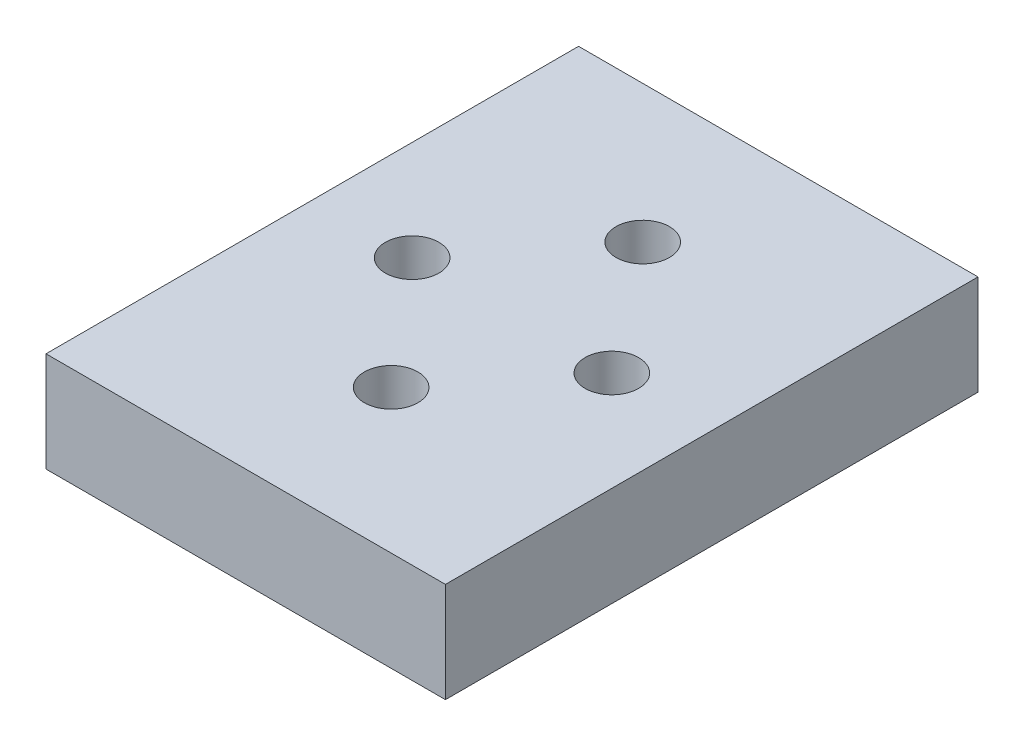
ISO-10303-21;
HEADER;
FILE_DESCRIPTION(('STEP AP214'),'2;1');
FILE_NAME('part.step','',(''),(''),'','','');
FILE_SCHEMA(('AUTOMOTIVE_DESIGN { 1 0 10303 214 1 1 1 1 }'));
ENDSEC;
DATA;
#1=APPLICATION_CONTEXT('core data for automotive mechanical design processes');
#2=APPLICATION_PROTOCOL_DEFINITION('international standard','automotive_design',2000,#1);
#3=PRODUCT_CONTEXT('',#1,'mechanical');
#4=PRODUCT('Part','Part','',(#3));
#5=PRODUCT_RELATED_PRODUCT_CATEGORY('part','',(#4));
#6=PRODUCT_DEFINITION_FORMATION('','',#4);
#7=PRODUCT_DEFINITION_CONTEXT('part definition',#1,'design');
#8=PRODUCT_DEFINITION('design','',#6,#7);
#9=PRODUCT_DEFINITION_SHAPE('','',#8);
#10=(LENGTH_UNIT() NAMED_UNIT(*) SI_UNIT(.MILLI.,.METRE.));
#11=(NAMED_UNIT(*) PLANE_ANGLE_UNIT() SI_UNIT($,.RADIAN.));
#12=(NAMED_UNIT(*) SI_UNIT($,.STERADIAN.) SOLID_ANGLE_UNIT());
#13=UNCERTAINTY_MEASURE_WITH_UNIT(LENGTH_MEASURE(1.E-05),#10,'distance_accuracy_value','');
#14=(GEOMETRIC_REPRESENTATION_CONTEXT(3) GLOBAL_UNCERTAINTY_ASSIGNED_CONTEXT((#13)) GLOBAL_UNIT_ASSIGNED_CONTEXT((#10,
#11,#12)) REPRESENTATION_CONTEXT('',''));
#15=CARTESIAN_POINT('',(0.,0.,0.));
#16=DIRECTION('',(0.,0.,1.));
#17=DIRECTION('',(1.,0.,0.));
#18=AXIS2_PLACEMENT_3D('',#15,#16,#17);
#19=CARTESIAN_POINT('',(19.05,4.7625,-25.4));
#20=DIRECTION('',(-1.,0.,0.));
#21=DIRECTION('',(0.,0.,1.));
#22=AXIS2_PLACEMENT_3D('',#19,#20,#21);
#23=PLANE('',#22);
#24=DIRECTION('',(0.,0.,-1.));
#25=VECTOR('',#24,1.);
#26=CARTESIAN_POINT('',(19.05,-4.7625,-25.4));
#27=LINE('',#26,#25);
#28=CARTESIAN_POINT('',(19.05,-4.7625,25.4));
#29=VERTEX_POINT('',#28);
#30=CARTESIAN_POINT('',(19.05,-4.7625,-25.4));
#31=VERTEX_POINT('',#30);
#32=EDGE_CURVE('E100',#29,#31,#27,.T.);
#33=ORIENTED_EDGE('',*,*,#32,.T.);
#34=DIRECTION('',(0.,-1.,0.));
#35=VECTOR('',#34,1.);
#36=CARTESIAN_POINT('',(19.05,4.7625,-25.4));
#37=LINE('',#36,#35);
#38=CARTESIAN_POINT('',(19.05,4.7625,-25.4));
#39=VERTEX_POINT('',#38);
#40=EDGE_CURVE('E11',#39,#31,#37,.T.);
#41=ORIENTED_EDGE('',*,*,#40,.F.);
#42=DIRECTION('',(0.,0.,-1.));
#43=VECTOR('',#42,1.);
#44=CARTESIAN_POINT('',(19.05,4.7625,-25.4));
#45=LINE('',#44,#43);
#46=CARTESIAN_POINT('',(19.05,4.7625,25.4));
#47=VERTEX_POINT('',#46);
#48=EDGE_CURVE('E88',#47,#39,#45,.T.);
#49=ORIENTED_EDGE('',*,*,#48,.F.);
#50=DIRECTION('',(0.,-1.,0.));
#51=VECTOR('',#50,1.);
#52=CARTESIAN_POINT('',(19.05,4.7625,25.4));
#53=LINE('',#52,#51);
#54=EDGE_CURVE('E96',#47,#29,#53,.T.);
#55=ORIENTED_EDGE('',*,*,#54,.T.);
#56=EDGE_LOOP('',(#33,#41,#49,#55));
#57=FACE_BOUND('',#56,.T.);
#58=ADVANCED_FACE('F37',(#57),#23,.F.);
#59=CARTESIAN_POINT('',(-19.05,4.7625,-25.4));
#60=DIRECTION('',(0.,0.,1.));
#61=DIRECTION('',(1.,0.,0.));
#62=AXIS2_PLACEMENT_3D('',#59,#60,#61);
#63=PLANE('',#62);
#64=DIRECTION('',(-1.,0.,0.));
#65=VECTOR('',#64,1.);
#66=CARTESIAN_POINT('',(-19.05,-4.7625,-25.4));
#67=LINE('',#66,#65);
#68=CARTESIAN_POINT('',(-19.05,-4.7625,-25.4));
#69=VERTEX_POINT('',#68);
#70=EDGE_CURVE('E92',#31,#69,#67,.T.);
#71=ORIENTED_EDGE('',*,*,#70,.T.);
#72=DIRECTION('',(0.,-1.,0.));
#73=VECTOR('',#72,1.);
#74=CARTESIAN_POINT('',(-19.05,4.7625,-25.4));
#75=LINE('',#74,#73);
#76=CARTESIAN_POINT('',(-19.05,4.7625,-25.4));
#77=VERTEX_POINT('',#76);
#78=EDGE_CURVE('E45',#77,#69,#75,.T.);
#79=ORIENTED_EDGE('',*,*,#78,.F.);
#80=DIRECTION('',(-1.,0.,0.));
#81=VECTOR('',#80,1.);
#82=CARTESIAN_POINT('',(-19.05,4.7625,-25.4));
#83=LINE('',#82,#81);
#84=EDGE_CURVE('E83',#39,#77,#83,.T.);
#85=ORIENTED_EDGE('',*,*,#84,.F.);
#86=ORIENTED_EDGE('',*,*,#40,.T.);
#87=EDGE_LOOP('',(#71,#79,#85,#86));
#88=FACE_BOUND('',#87,.T.);
#89=ADVANCED_FACE('F91',(#88),#63,.F.);
#90=CARTESIAN_POINT('',(-19.05,4.7625,-25.4));
#91=DIRECTION('',(1.,0.,0.));
#92=DIRECTION('',(0.,0.,-1.));
#93=AXIS2_PLACEMENT_3D('',#90,#91,#92);
#94=PLANE('',#93);
#95=DIRECTION('',(0.,0.,1.));
#96=VECTOR('',#95,1.);
#97=CARTESIAN_POINT('',(-19.05,-4.7625,-25.4));
#98=LINE('',#97,#96);
#99=CARTESIAN_POINT('',(-19.05,-4.7625,25.4));
#100=VERTEX_POINT('',#99);
#101=EDGE_CURVE('E70',#69,#100,#98,.T.);
#102=ORIENTED_EDGE('',*,*,#101,.T.);
#103=DIRECTION('',(0.,-1.,0.));
#104=VECTOR('',#103,1.);
#105=CARTESIAN_POINT('',(-19.05,4.7625,25.4));
#106=LINE('',#105,#104);
#107=CARTESIAN_POINT('',(-19.05,4.7625,25.4));
#108=VERTEX_POINT('',#107);
#109=EDGE_CURVE('E93',#108,#100,#106,.T.);
#110=ORIENTED_EDGE('',*,*,#109,.F.);
#111=DIRECTION('',(0.,0.,1.));
#112=VECTOR('',#111,1.);
#113=CARTESIAN_POINT('',(-19.05,4.7625,-25.4));
#114=LINE('',#113,#112);
#115=EDGE_CURVE('E86',#77,#108,#114,.T.);
#116=ORIENTED_EDGE('',*,*,#115,.F.);
#117=ORIENTED_EDGE('',*,*,#78,.T.);
#118=EDGE_LOOP('',(#102,#110,#116,#117));
#119=FACE_BOUND('',#118,.T.);
#120=ADVANCED_FACE('F94',(#119),#94,.F.);
#121=CARTESIAN_POINT('',(-19.05,4.7625,25.4));
#122=DIRECTION('',(0.,0.,-1.));
#123=DIRECTION('',(-1.,0.,0.));
#124=AXIS2_PLACEMENT_3D('',#121,#122,#123);
#125=PLANE('',#124);
#126=DIRECTION('',(1.,0.,0.));
#127=VECTOR('',#126,1.);
#128=CARTESIAN_POINT('',(-19.05,-4.7625,25.4));
#129=LINE('',#128,#127);
#130=EDGE_CURVE('E76',#100,#29,#129,.T.);
#131=ORIENTED_EDGE('',*,*,#130,.T.);
#132=ORIENTED_EDGE('',*,*,#54,.F.);
#133=DIRECTION('',(1.,0.,0.));
#134=VECTOR('',#133,1.);
#135=CARTESIAN_POINT('',(-19.05,4.7625,25.4));
#136=LINE('',#135,#134);
#137=EDGE_CURVE('E53',#108,#47,#136,.T.);
#138=ORIENTED_EDGE('',*,*,#137,.F.);
#139=ORIENTED_EDGE('',*,*,#109,.T.);
#140=EDGE_LOOP('',(#131,#132,#138,#139));
#141=FACE_BOUND('',#140,.T.);
#142=ADVANCED_FACE('F108',(#141),#125,.F.);
#143=CARTESIAN_POINT('',(0.,4.7625,0.));
#144=DIRECTION('',(0.,1.,0.));
#145=DIRECTION('',(0.,0.,1.));
#146=AXIS2_PLACEMENT_3D('',#143,#144,#145);
#147=PLANE('',#146);
#148=CARTESIAN_POINT('',(0.18139999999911,4.7625,11.7111139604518));
#149=DIRECTION('',(0.,-1.,0.));
#150=DIRECTION('',(0.,0.,-1.));
#151=AXIS2_PLACEMENT_3D('',#148,#149,#150);
#152=CIRCLE('',#151,2.5527);
#153=CARTESIAN_POINT('',(0.18139999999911,4.7625,9.15841396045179));
#154=VERTEX_POINT('',#153);
#155=EDGE_CURVE('E143',#154,#154,#152,.T.);
#156=ORIENTED_EDGE('',*,*,#155,.T.);
#157=EDGE_LOOP('',(#156));
#158=FACE_BOUND('',#157,.T.);
#159=CARTESIAN_POINT('',(0.181399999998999,4.7625,-12.2888860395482));
#160=DIRECTION('',(0.,-1.,0.));
#161=DIRECTION('',(0.,0.,-1.));
#162=AXIS2_PLACEMENT_3D('',#159,#160,#161);
#163=CIRCLE('',#162,2.5527);
#164=CARTESIAN_POINT('',(0.181399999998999,4.7625,-14.8415860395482));
#165=VERTEX_POINT('',#164);
#166=EDGE_CURVE('E137',#165,#165,#163,.T.);
#167=ORIENTED_EDGE('',*,*,#166,.T.);
#168=EDGE_LOOP('',(#167));
#169=FACE_BOUND('',#168,.T.);
#170=CARTESIAN_POINT('',(9.525,4.7625,0.));
#171=DIRECTION('',(0.,-1.,0.));
#172=DIRECTION('',(0.,0.,-1.));
#173=AXIS2_PLACEMENT_3D('',#170,#171,#172);
#174=CIRCLE('',#173,2.5527);
#175=CARTESIAN_POINT('',(9.525,4.7625,-2.5527));
#176=VERTEX_POINT('',#175);
#177=EDGE_CURVE('E125',#176,#176,#174,.T.);
#178=ORIENTED_EDGE('',*,*,#177,.T.);
#179=EDGE_LOOP('',(#178));
#180=FACE_BOUND('',#179,.T.);
#181=CARTESIAN_POINT('',(-9.52499999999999,4.7625,0.));
#182=DIRECTION('',(0.,-1.,0.));
#183=DIRECTION('',(0.,0.,-1.));
#184=AXIS2_PLACEMENT_3D('',#181,#182,#183);
#185=CIRCLE('',#184,2.5527);
#186=CARTESIAN_POINT('',(-9.52499999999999,4.7625,-2.5527));
#187=VERTEX_POINT('',#186);
#188=EDGE_CURVE('E103',#187,#187,#185,.T.);
#189=ORIENTED_EDGE('',*,*,#188,.T.);
#190=EDGE_LOOP('',(#189));
#191=FACE_BOUND('',#190,.T.);
#192=ORIENTED_EDGE('',*,*,#48,.T.);
#193=ORIENTED_EDGE('',*,*,#84,.T.);
#194=ORIENTED_EDGE('',*,*,#115,.T.);
#195=ORIENTED_EDGE('',*,*,#137,.T.);
#196=EDGE_LOOP('',(#192,#193,#194,#195));
#197=FACE_BOUND('',#196,.T.);
#198=ADVANCED_FACE('F84',(#158,#169,#180,#191,#197),#147,.T.);
#199=CARTESIAN_POINT('',(0.,-4.7625,0.));
#200=DIRECTION('',(0.,1.,0.));
#201=DIRECTION('',(0.,0.,1.));
#202=AXIS2_PLACEMENT_3D('',#199,#200,#201);
#203=PLANE('',#202);
#204=CARTESIAN_POINT('',(0.18139999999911,-4.7625,11.7111139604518));
#205=DIRECTION('',(0.,-1.,0.));
#206=DIRECTION('',(0.,0.,-1.));
#207=AXIS2_PLACEMENT_3D('',#204,#205,#206);
#208=CIRCLE('',#207,2.55269999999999);
#209=CARTESIAN_POINT('',(0.18139999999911,-4.7625,9.1584139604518));
#210=VERTEX_POINT('',#209);
#211=EDGE_CURVE('E146',#210,#210,#208,.T.);
#212=ORIENTED_EDGE('',*,*,#211,.F.);
#213=EDGE_LOOP('',(#212));
#214=FACE_BOUND('',#213,.T.);
#215=CARTESIAN_POINT('',(0.181399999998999,-4.7625,-12.2888860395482));
#216=DIRECTION('',(0.,-1.,0.));
#217=DIRECTION('',(0.,0.,-1.));
#218=AXIS2_PLACEMENT_3D('',#215,#216,#217);
#219=CIRCLE('',#218,2.55269999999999);
#220=CARTESIAN_POINT('',(0.181399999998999,-4.7625,-14.8415860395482));
#221=VERTEX_POINT('',#220);
#222=EDGE_CURVE('E140',#221,#221,#219,.T.);
#223=ORIENTED_EDGE('',*,*,#222,.F.);
#224=EDGE_LOOP('',(#223));
#225=FACE_BOUND('',#224,.T.);
#226=CARTESIAN_POINT('',(9.525,-4.7625,0.));
#227=DIRECTION('',(0.,-1.,0.));
#228=DIRECTION('',(0.,0.,-1.));
#229=AXIS2_PLACEMENT_3D('',#226,#227,#228);
#230=CIRCLE('',#229,4.7625);
#231=CARTESIAN_POINT('',(9.525,-4.7625,-4.7625));
#232=VERTEX_POINT('',#231);
#233=EDGE_CURVE('E134',#232,#232,#230,.T.);
#234=ORIENTED_EDGE('',*,*,#233,.F.);
#235=EDGE_LOOP('',(#234));
#236=FACE_BOUND('',#235,.T.);
#237=CARTESIAN_POINT('',(-9.52499999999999,-4.7625,0.));
#238=DIRECTION('',(0.,-1.,0.));
#239=DIRECTION('',(0.,0.,-1.));
#240=AXIS2_PLACEMENT_3D('',#237,#238,#239);
#241=CIRCLE('',#240,4.7625);
#242=CARTESIAN_POINT('',(-9.52499999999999,-4.7625,-4.7625));
#243=VERTEX_POINT('',#242);
#244=EDGE_CURVE('E122',#243,#243,#241,.T.);
#245=ORIENTED_EDGE('',*,*,#244,.F.);
#246=EDGE_LOOP('',(#245));
#247=FACE_BOUND('',#246,.T.);
#248=ORIENTED_EDGE('',*,*,#32,.F.);
#249=ORIENTED_EDGE('',*,*,#130,.F.);
#250=ORIENTED_EDGE('',*,*,#101,.F.);
#251=ORIENTED_EDGE('',*,*,#70,.F.);
#252=EDGE_LOOP('',(#248,#249,#250,#251));
#253=FACE_BOUND('',#252,.T.);
#254=ADVANCED_FACE('F111',(#214,#225,#236,#247,#253),#203,.F.);
#255=CARTESIAN_POINT('',(-9.52499999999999,-4.7625,0.));
#256=DIRECTION('',(0.,-1.,0.));
#257=DIRECTION('',(0.,0.,-1.));
#258=AXIS2_PLACEMENT_3D('',#255,#256,#257);
#259=CYLINDRICAL_SURFACE('',#258,2.5527);
#260=ORIENTED_EDGE('',*,*,#188,.F.);
#261=EDGE_LOOP('',(#260));
#262=FACE_BOUND('',#261,.T.);
#263=CARTESIAN_POINT('',(-9.52499999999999,0.0634999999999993,0.));
#264=DIRECTION('',(0.,-1.,0.));
#265=DIRECTION('',(0.,0.,-1.));
#266=AXIS2_PLACEMENT_3D('',#263,#264,#265);
#267=CIRCLE('',#266,2.5527);
#268=CARTESIAN_POINT('',(-9.52499999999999,0.0634999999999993,-2.5527));
#269=VERTEX_POINT('',#268);
#270=EDGE_CURVE('E116',#269,#269,#267,.T.);
#271=ORIENTED_EDGE('',*,*,#270,.T.);
#272=EDGE_LOOP('',(#271));
#273=FACE_BOUND('',#272,.T.);
#274=ADVANCED_FACE('F154',(#262,#273),#259,.F.);
#275=CARTESIAN_POINT('',(-6.97229999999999,0.0634999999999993,0.));
#276=DIRECTION('',(0.,1.,0.));
#277=DIRECTION('',(0.,0.,1.));
#278=AXIS2_PLACEMENT_3D('',#275,#276,#277);
#279=PLANE('',#278);
#280=ORIENTED_EDGE('',*,*,#270,.F.);
#281=EDGE_LOOP('',(#280));
#282=FACE_BOUND('',#281,.T.);
#283=CARTESIAN_POINT('',(-9.52499999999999,0.0634999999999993,0.));
#284=DIRECTION('',(0.,-1.,0.));
#285=DIRECTION('',(0.,0.,-1.));
#286=AXIS2_PLACEMENT_3D('',#283,#284,#285);
#287=CIRCLE('',#286,4.7625);
#288=CARTESIAN_POINT('',(-9.52499999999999,0.0634999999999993,-4.7625));
#289=VERTEX_POINT('',#288);
#290=EDGE_CURVE('E119',#289,#289,#287,.T.);
#291=ORIENTED_EDGE('',*,*,#290,.T.);
#292=EDGE_LOOP('',(#291));
#293=FACE_BOUND('',#292,.T.);
#294=ADVANCED_FACE('F165',(#282,#293),#279,.F.);
#295=CARTESIAN_POINT('',(-9.52499999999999,-4.7625,0.));
#296=DIRECTION('',(0.,-1.,0.));
#297=DIRECTION('',(0.,0.,-1.));
#298=AXIS2_PLACEMENT_3D('',#295,#296,#297);
#299=CYLINDRICAL_SURFACE('',#298,4.7625);
#300=ORIENTED_EDGE('',*,*,#290,.F.);
#301=EDGE_LOOP('',(#300));
#302=FACE_BOUND('',#301,.T.);
#303=ORIENTED_EDGE('',*,*,#244,.T.);
#304=EDGE_LOOP('',(#303));
#305=FACE_BOUND('',#304,.T.);
#306=ADVANCED_FACE('F162',(#302,#305),#299,.F.);
#307=CARTESIAN_POINT('',(9.525,-4.7625,0.));
#308=DIRECTION('',(0.,-1.,0.));
#309=DIRECTION('',(0.,0.,-1.));
#310=AXIS2_PLACEMENT_3D('',#307,#308,#309);
#311=CYLINDRICAL_SURFACE('',#310,2.5527);
#312=ORIENTED_EDGE('',*,*,#177,.F.);
#313=EDGE_LOOP('',(#312));
#314=FACE_BOUND('',#313,.T.);
#315=CARTESIAN_POINT('',(9.525,0.0634999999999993,0.));
#316=DIRECTION('',(0.,-1.,0.));
#317=DIRECTION('',(0.,0.,-1.));
#318=AXIS2_PLACEMENT_3D('',#315,#316,#317);
#319=CIRCLE('',#318,2.5527);
#320=CARTESIAN_POINT('',(9.525,0.0634999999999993,-2.5527));
#321=VERTEX_POINT('',#320);
#322=EDGE_CURVE('E128',#321,#321,#319,.T.);
#323=ORIENTED_EDGE('',*,*,#322,.T.);
#324=EDGE_LOOP('',(#323));
#325=FACE_BOUND('',#324,.T.);
#326=ADVANCED_FACE('F164',(#314,#325),#311,.F.);
#327=CARTESIAN_POINT('',(12.0777,0.0634999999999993,0.));
#328=DIRECTION('',(0.,1.,0.));
#329=DIRECTION('',(0.,0.,1.));
#330=AXIS2_PLACEMENT_3D('',#327,#328,#329);
#331=PLANE('',#330);
#332=ORIENTED_EDGE('',*,*,#322,.F.);
#333=EDGE_LOOP('',(#332));
#334=FACE_BOUND('',#333,.T.);
#335=CARTESIAN_POINT('',(9.525,0.0634999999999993,0.));
#336=DIRECTION('',(0.,-1.,0.));
#337=DIRECTION('',(0.,0.,-1.));
#338=AXIS2_PLACEMENT_3D('',#335,#336,#337);
#339=CIRCLE('',#338,4.7625);
#340=CARTESIAN_POINT('',(9.525,0.0634999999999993,-4.7625));
#341=VERTEX_POINT('',#340);
#342=EDGE_CURVE('E131',#341,#341,#339,.T.);
#343=ORIENTED_EDGE('',*,*,#342,.T.);
#344=EDGE_LOOP('',(#343));
#345=FACE_BOUND('',#344,.T.);
#346=ADVANCED_FACE('F172',(#334,#345),#331,.F.);
#347=CARTESIAN_POINT('',(9.525,-4.7625,0.));
#348=DIRECTION('',(0.,-1.,0.));
#349=DIRECTION('',(0.,0.,-1.));
#350=AXIS2_PLACEMENT_3D('',#347,#348,#349);
#351=CYLINDRICAL_SURFACE('',#350,4.7625);
#352=ORIENTED_EDGE('',*,*,#342,.F.);
#353=EDGE_LOOP('',(#352));
#354=FACE_BOUND('',#353,.T.);
#355=ORIENTED_EDGE('',*,*,#233,.T.);
#356=EDGE_LOOP('',(#355));
#357=FACE_BOUND('',#356,.T.);
#358=ADVANCED_FACE('F229',(#354,#357),#351,.F.);
#359=CARTESIAN_POINT('',(0.181399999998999,-4.7625,-12.2888860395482));
#360=DIRECTION('',(0.,-1.,0.));
#361=DIRECTION('',(0.,0.,-1.));
#362=AXIS2_PLACEMENT_3D('',#359,#360,#361);
#363=CYLINDRICAL_SURFACE('',#362,2.55269999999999);
#364=ORIENTED_EDGE('',*,*,#166,.F.);
#365=EDGE_LOOP('',(#364));
#366=FACE_BOUND('',#365,.T.);
#367=ORIENTED_EDGE('',*,*,#222,.T.);
#368=EDGE_LOOP('',(#367));
#369=FACE_BOUND('',#368,.T.);
#370=ADVANCED_FACE('F238',(#366,#369),#363,.F.);
#371=CARTESIAN_POINT('',(0.18139999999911,-4.7625,11.7111139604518));
#372=DIRECTION('',(0.,-1.,0.));
#373=DIRECTION('',(0.,0.,-1.));
#374=AXIS2_PLACEMENT_3D('',#371,#372,#373);
#375=CYLINDRICAL_SURFACE('',#374,2.55269999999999);
#376=ORIENTED_EDGE('',*,*,#155,.F.);
#377=EDGE_LOOP('',(#376));
#378=FACE_BOUND('',#377,.T.);
#379=ORIENTED_EDGE('',*,*,#211,.T.);
#380=EDGE_LOOP('',(#379));
#381=FACE_BOUND('',#380,.T.);
#382=ADVANCED_FACE('F150',(#378,#381),#375,.F.);
#383=CLOSED_SHELL('',(#58,#89,#120,#142,#198,#254,#274,#294,#306,#326,#346,#358,#370,#382));
#384=MANIFOLD_SOLID_BREP('B2',#383);
#385=ADVANCED_BREP_SHAPE_REPRESENTATION('',(#18,#384),#14);
#386=SHAPE_DEFINITION_REPRESENTATION(#9,#385);
ENDSEC;
END-ISO-10303-21;
